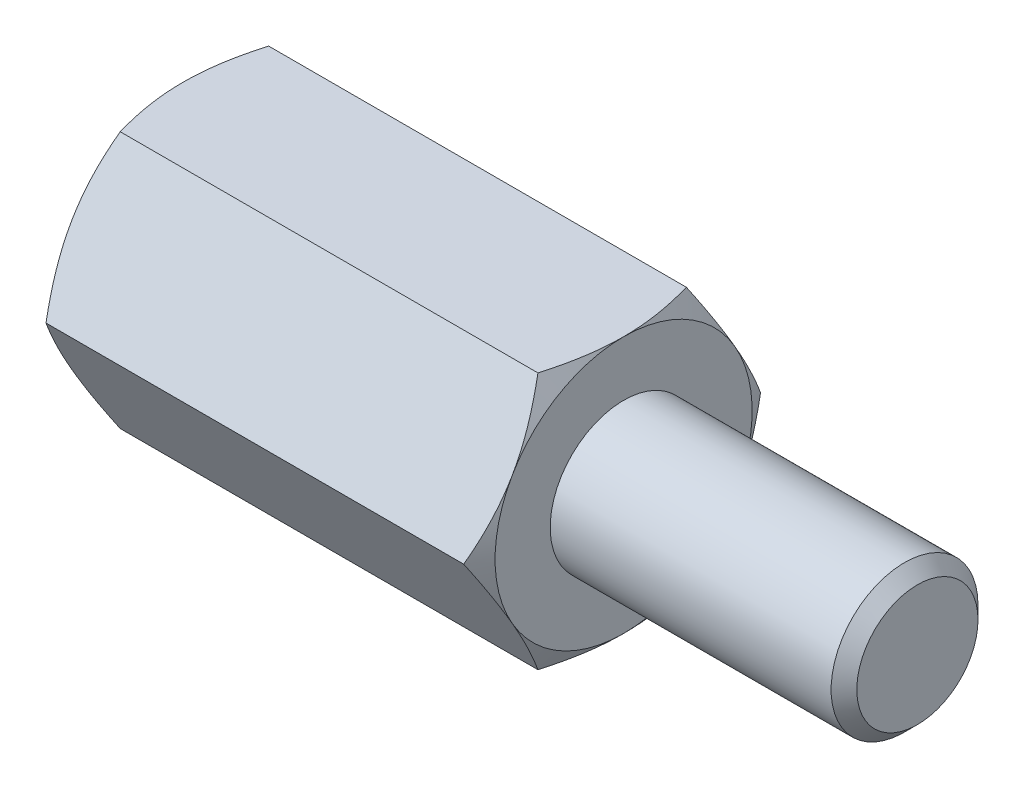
ISO-10303-21;
HEADER;
FILE_DESCRIPTION(('STEP AP214'),'2;1');
FILE_NAME('part.step','',(''),(''),'','','');
FILE_SCHEMA(('AUTOMOTIVE_DESIGN { 1 0 10303 214 1 1 1 1 }'));
ENDSEC;
DATA;
#1=APPLICATION_CONTEXT('core data for automotive mechanical design processes');
#2=APPLICATION_PROTOCOL_DEFINITION('international standard','automotive_design',2000,#1);
#3=PRODUCT_CONTEXT('',#1,'mechanical');
#4=PRODUCT('Part','Part','',(#3));
#5=PRODUCT_RELATED_PRODUCT_CATEGORY('part','',(#4));
#6=PRODUCT_DEFINITION_FORMATION('','',#4);
#7=PRODUCT_DEFINITION_CONTEXT('part definition',#1,'design');
#8=PRODUCT_DEFINITION('design','',#6,#7);
#9=PRODUCT_DEFINITION_SHAPE('','',#8);
#10=(LENGTH_UNIT() NAMED_UNIT(*) SI_UNIT(.MILLI.,.METRE.));
#11=(NAMED_UNIT(*) PLANE_ANGLE_UNIT() SI_UNIT($,.RADIAN.));
#12=(NAMED_UNIT(*) SI_UNIT($,.STERADIAN.) SOLID_ANGLE_UNIT());
#13=UNCERTAINTY_MEASURE_WITH_UNIT(LENGTH_MEASURE(1.E-05),#10,'distance_accuracy_value','');
#14=(GEOMETRIC_REPRESENTATION_CONTEXT(3) GLOBAL_UNCERTAINTY_ASSIGNED_CONTEXT((#13)) GLOBAL_UNIT_ASSIGNED_CONTEXT((#10,
#11,#12)) REPRESENTATION_CONTEXT('',''));
#15=CARTESIAN_POINT('',(0.,0.,0.));
#16=DIRECTION('',(0.,0.,1.));
#17=DIRECTION('',(1.,0.,0.));
#18=AXIS2_PLACEMENT_3D('',#15,#16,#17);
#19=CARTESIAN_POINT('',(6.,3.5,-2.02072594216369));
#20=DIRECTION('',(1.,0.,0.));
#21=DIRECTION('',(0.,0.,-1.));
#22=AXIS2_PLACEMENT_3D('',#19,#20,#21);
#23=PLANE('',#22);
#24=CARTESIAN_POINT('',(6.,0.,0.));
#25=DIRECTION('',(1.,0.,0.));
#26=DIRECTION('',(0.,0.,-1.));
#27=AXIS2_PLACEMENT_3D('',#24,#25,#26);
#28=CIRCLE('',#27,3.5);
#29=CARTESIAN_POINT('',(6.,-1.75,-3.03108891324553));
#30=VERTEX_POINT('',#29);
#31=CARTESIAN_POINT('',(6.,1.75,-3.03108891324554));
#32=VERTEX_POINT('',#31);
#33=EDGE_CURVE('E288',#30,#32,#28,.T.);
#34=ORIENTED_EDGE('',*,*,#33,.T.);
#35=CARTESIAN_POINT('',(6.,3.5,0.));
#36=VERTEX_POINT('',#35);
#37=EDGE_CURVE('E53',#32,#36,#28,.T.);
#38=ORIENTED_EDGE('',*,*,#37,.T.);
#39=CARTESIAN_POINT('',(6.,1.75,3.03108891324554));
#40=VERTEX_POINT('',#39);
#41=EDGE_CURVE('E297',#36,#40,#28,.T.);
#42=ORIENTED_EDGE('',*,*,#41,.T.);
#43=CARTESIAN_POINT('',(6.,-1.75,3.03108891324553));
#44=VERTEX_POINT('',#43);
#45=EDGE_CURVE('E301',#40,#44,#28,.T.);
#46=ORIENTED_EDGE('',*,*,#45,.T.);
#47=CARTESIAN_POINT('',(6.,0.,0.));
#48=DIRECTION('',(-1.,0.,0.));
#49=DIRECTION('',(0.,-1.,0.));
#50=AXIS2_PLACEMENT_3D('',#47,#48,#49);
#51=CIRCLE('',#50,3.5);
#52=CARTESIAN_POINT('',(6.,-3.5,0.));
#53=VERTEX_POINT('',#52);
#54=EDGE_CURVE('E193',#53,#44,#51,.T.);
#55=ORIENTED_EDGE('',*,*,#54,.F.);
#56=EDGE_CURVE('E61',#53,#30,#28,.T.);
#57=ORIENTED_EDGE('',*,*,#56,.T.);
#58=EDGE_LOOP('',(#34,#38,#42,#46,#55,#57));
#59=FACE_BOUND('',#58,.T.);
#60=CARTESIAN_POINT('',(6.,0.,0.));
#61=DIRECTION('',(1.,0.,0.));
#62=DIRECTION('',(0.,0.,-1.));
#63=AXIS2_PLACEMENT_3D('',#60,#61,#62);
#64=CIRCLE('',#63,2.);
#65=CARTESIAN_POINT('',(6.,0.,-2.));
#66=VERTEX_POINT('',#65);
#67=EDGE_CURVE('E311',#66,#66,#64,.T.);
#68=ORIENTED_EDGE('',*,*,#67,.F.);
#69=EDGE_LOOP('',(#68));
#70=FACE_BOUND('',#69,.T.);
#71=ADVANCED_FACE('F37',(#59,#70),#23,.T.);
#72=CARTESIAN_POINT('',(6.,0.,-4.04145188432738));
#73=DIRECTION('',(0.,-0.5,0.866025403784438));
#74=DIRECTION('',(0.,-0.866025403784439,-0.5));
#75=AXIS2_PLACEMENT_3D('',#72,#73,#74);
#76=PLANE('',#75);
#77=CARTESIAN_POINT('',(5.68732593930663,-0.000200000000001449,-4.04156735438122));
#78=CARTESIAN_POINT('',(5.73861421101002,0.153607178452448,-3.9527667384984));
#79=CARTESIAN_POINT('',(5.78525904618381,0.308742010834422,-3.86319960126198));
#80=CARTESIAN_POINT('',(5.86667812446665,0.621698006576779,-3.68251437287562));
#81=CARTESIAN_POINT('',(5.90142356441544,0.779524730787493,-3.59139307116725));
#82=CARTESIAN_POINT('',(5.95550997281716,1.09322221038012,-3.41027974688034));
#83=CARTESIAN_POINT('',(5.97521091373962,1.24904469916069,-3.32031559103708));
#84=CARTESIAN_POINT('',(5.99872986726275,1.56142288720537,-3.13996396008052));
#85=CARTESIAN_POINT('',(6.00256735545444,1.71797745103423,-3.04957714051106));
#86=CARTESIAN_POINT('',(5.99458469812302,2.01050921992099,-2.88068384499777));
#87=CARTESIAN_POINT('',(5.98472456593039,2.1465302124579,-2.80215208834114));
#88=CARTESIAN_POINT('',(5.9534735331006,2.41768602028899,-2.64560020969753));
#89=CARTESIAN_POINT('',(5.9320719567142,2.55281989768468,-2.5675806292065));
#90=CARTESIAN_POINT('',(5.87856959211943,2.82453479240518,-2.41070596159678));
#91=CARTESIAN_POINT('',(5.84624200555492,2.96108141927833,-2.33187072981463));
#92=CARTESIAN_POINT('',(5.77287106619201,3.2321380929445,-2.17537608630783));
#93=CARTESIAN_POINT('',(5.73184495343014,3.36665161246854,-2.09771466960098));
#94=CARTESIAN_POINT('',(5.68732593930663,3.5002,-2.02061047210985));
#95=B_SPLINE_CURVE_WITH_KNOTS('',3,(#77,#78,#79,#80,#81,#82,#83,#84,#85,#86,#87,#88,#89,#90,#91,
#92,#93,#94),.UNSPECIFIED.,.F.,.F.,(4,2,2,2,2,2,2,2,4),(0.,0.554793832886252,1.11092123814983,
1.65328467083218,2.19498204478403,2.6666513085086,3.13875761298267,3.6213361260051,
4.10296698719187),.UNSPECIFIED.);
#96=CARTESIAN_POINT('',(5.68739260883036,0.,-4.04145188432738));
#97=VERTEX_POINT('',#96);
#98=EDGE_CURVE('E315',#97,#32,#95,.T.);
#99=ORIENTED_EDGE('',*,*,#98,.F.);
#100=DIRECTION('',(-1.,0.,0.));
#101=VECTOR('',#100,1.);
#102=CARTESIAN_POINT('',(6.,0.,-4.04145188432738));
#103=LINE('',#102,#101);
#104=CARTESIAN_POINT('',(-5.68739260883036,0.,-4.04145188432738));
#105=VERTEX_POINT('',#104);
#106=EDGE_CURVE('E264',#97,#105,#103,.T.);
#107=ORIENTED_EDGE('',*,*,#106,.T.);
#108=CARTESIAN_POINT('',(-5.68732593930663,3.5002,-2.02061047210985));
#109=CARTESIAN_POINT('',(-5.73861421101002,3.34639282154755,-2.10941108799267));
#110=CARTESIAN_POINT('',(-5.78525904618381,3.19125798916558,-2.19897822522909));
#111=CARTESIAN_POINT('',(-5.86667812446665,2.87830199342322,-2.37966345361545));
#112=CARTESIAN_POINT('',(-5.90142356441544,2.7204752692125,-2.47078475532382));
#113=CARTESIAN_POINT('',(-5.95550997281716,2.40677778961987,-2.65189807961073));
#114=CARTESIAN_POINT('',(-5.97521091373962,2.25095530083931,-2.74186223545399));
#115=CARTESIAN_POINT('',(-5.99872986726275,1.93857711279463,-2.92221386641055));
#116=CARTESIAN_POINT('',(-6.00256735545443,1.78202254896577,-3.01260068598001));
#117=CARTESIAN_POINT('',(-5.99458469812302,1.48949078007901,-3.1814939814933));
#118=CARTESIAN_POINT('',(-5.98472456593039,1.3534697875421,-3.26002573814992));
#119=CARTESIAN_POINT('',(-5.9534735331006,1.08231397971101,-3.41657761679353));
#120=CARTESIAN_POINT('',(-5.9320719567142,0.947180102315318,-3.49459719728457));
#121=CARTESIAN_POINT('',(-5.87856959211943,0.675465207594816,-3.65147186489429));
#122=CARTESIAN_POINT('',(-5.84624200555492,0.538918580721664,-3.73030709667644));
#123=CARTESIAN_POINT('',(-5.77287106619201,0.267861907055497,-3.88680174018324));
#124=CARTESIAN_POINT('',(-5.73184495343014,0.133348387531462,-3.96446315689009));
#125=CARTESIAN_POINT('',(-5.68732593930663,-0.000200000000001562,-4.04156735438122));
#126=B_SPLINE_CURVE_WITH_KNOTS('',3,(#108,#109,#110,#111,#112,#113,#114,#115,#116,#117,#118,
#119,#120,#121,#122,#123,#124,#125),.UNSPECIFIED.,.F.,.F.,(4,2,2,2,2,2,2,2,4),(0.,
0.554793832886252,1.11092123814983,1.65328467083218,2.19498204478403,2.6666513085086,
3.13875761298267,3.6213361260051,4.10296698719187),.UNSPECIFIED.);
#127=CARTESIAN_POINT('',(-6.,1.75,-3.03108891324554));
#128=VERTEX_POINT('',#127);
#129=EDGE_CURVE('E367',#128,#105,#126,.T.);
#130=ORIENTED_EDGE('',*,*,#129,.F.);
#131=CARTESIAN_POINT('',(-5.68739260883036,3.5,-2.02072594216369));
#132=VERTEX_POINT('',#131);
#133=EDGE_CURVE('E371',#132,#128,#126,.T.);
#134=ORIENTED_EDGE('',*,*,#133,.F.);
#135=DIRECTION('',(-1.,0.,0.));
#136=VECTOR('',#135,1.);
#137=CARTESIAN_POINT('',(6.,3.5,-2.02072594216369));
#138=LINE('',#137,#136);
#139=CARTESIAN_POINT('',(5.68739260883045,3.5,-2.02072594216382));
#140=VERTEX_POINT('',#139);
#141=EDGE_CURVE('E279',#140,#132,#138,.T.);
#142=ORIENTED_EDGE('',*,*,#141,.F.);
#143=EDGE_CURVE('E229',#32,#140,#95,.T.);
#144=ORIENTED_EDGE('',*,*,#143,.F.);
#145=EDGE_LOOP('',(#99,#107,#130,#134,#142,#144));
#146=FACE_BOUND('',#145,.T.);
#147=ADVANCED_FACE('F148',(#146),#76,.F.);
#148=CARTESIAN_POINT('',(6.,3.5,-2.02072594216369));
#149=DIRECTION('',(0.,-1.,0.));
#150=DIRECTION('',(0.,0.,-1.));
#151=AXIS2_PLACEMENT_3D('',#148,#149,#150);
#152=PLANE('',#151);
#153=CARTESIAN_POINT('',(4.24432944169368,3.5,-5.52571367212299));
#154=CARTESIAN_POINT('',(4.3192813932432,3.5,-5.37200190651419));
#155=CARTESIAN_POINT('',(4.39354243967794,3.5,-5.21794762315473));
#156=CARTESIAN_POINT('',(4.54029601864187,3.5,-4.90897223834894));
#157=CARTESIAN_POINT('',(4.61278829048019,3.5,-4.75405101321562));
#158=CARTESIAN_POINT('',(4.75596172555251,3.5,-4.44240758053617));
#159=CARTESIAN_POINT('',(4.82663168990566,3.5,-4.28568021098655));
#160=CARTESIAN_POINT('',(4.96520746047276,3.5,-3.97101270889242));
#161=CARTESIAN_POINT('',(5.03311339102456,3.5,-3.81307263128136));
#162=CARTESIAN_POINT('',(5.16771439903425,3.5,-3.49026114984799));
#163=CARTESIAN_POINT('',(5.23428710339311,3.5,-3.32533845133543));
#164=CARTESIAN_POINT('',(5.36262677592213,3.5,-2.99359992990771));
#165=CARTESIAN_POINT('',(5.42439321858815,3.5,-2.82678390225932));
#166=CARTESIAN_POINT('',(5.54157006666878,3.5,-2.49127529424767));
#167=CARTESIAN_POINT('',(5.59699254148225,3.5,-2.32258697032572));
#168=CARTESIAN_POINT('',(5.69976794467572,3.5,-1.98279215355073));
#169=CARTESIAN_POINT('',(5.74712331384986,3.5,-1.81168640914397));
#170=CARTESIAN_POINT('',(5.83129873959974,3.5,-1.46793354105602));
#171=CARTESIAN_POINT('',(5.86817965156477,3.5,-1.2953015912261));
#172=CARTESIAN_POINT('',(5.92939557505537,3.5,-0.94779164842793));
#173=CARTESIAN_POINT('',(5.95373192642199,3.5,-0.772913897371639));
#174=CARTESIAN_POINT('',(5.9876038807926,3.5,-0.424108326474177));
#175=CARTESIAN_POINT('',(5.99733725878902,3.5,-0.25020019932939));
#176=CARTESIAN_POINT('',(6.00170533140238,3.5,0.0978233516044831));
#177=CARTESIAN_POINT('',(5.99633996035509,3.5,0.271938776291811));
#178=CARTESIAN_POINT('',(5.97501181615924,3.5,0.564711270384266));
#179=CARTESIAN_POINT('',(5.96289198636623,3.5,0.683667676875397));
#180=CARTESIAN_POINT('',(5.93230809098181,3.5,0.920767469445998));
#181=CARTESIAN_POINT('',(5.91384324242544,3.5,1.03891075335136));
#182=CARTESIAN_POINT('',(5.84989562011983,3.5,1.39193174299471));
#183=CARTESIAN_POINT('',(5.79586958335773,3.5,1.62528232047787));
#184=CARTESIAN_POINT('',(5.70145152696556,3.5,1.97433825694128));
#185=CARTESIAN_POINT('',(5.66729009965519,3.5,2.09183268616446));
#186=CARTESIAN_POINT('',(5.59523444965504,3.5,2.32568238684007));
#187=CARTESIAN_POINT('',(5.55734019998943,3.5,2.44203765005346));
#188=CARTESIAN_POINT('',(5.47844216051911,3.5,2.67364238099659));
#189=CARTESIAN_POINT('',(5.43743925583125,3.5,2.78889215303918));
#190=CARTESIAN_POINT('',(5.35282457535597,3.5,3.01842460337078));
#191=CARTESIAN_POINT('',(5.30921284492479,3.5,3.13270729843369));
#192=CARTESIAN_POINT('',(5.19582414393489,3.5,3.42150510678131));
#193=CARTESIAN_POINT('',(5.12456360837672,3.5,3.59543696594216));
#194=CARTESIAN_POINT('',(4.97810267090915,3.5,3.94163961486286));
#195=CARTESIAN_POINT('',(4.90290192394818,3.5,4.11391025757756));
#196=CARTESIAN_POINT('',(4.74942525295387,3.5,4.45713072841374));
#197=CARTESIAN_POINT('',(4.67114846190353,3.5,4.62808016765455));
#198=CARTESIAN_POINT('',(4.51218826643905,3.5,4.96885843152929));
#199=CARTESIAN_POINT('',(4.43150479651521,3.5,5.13868722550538));
#200=CARTESIAN_POINT('',(4.18638713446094,3.5,5.64726192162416));
#201=CARTESIAN_POINT('',(4.0190975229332,3.5,5.98463020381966));
#202=CARTESIAN_POINT('',(3.67958549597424,3.5,6.65678495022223));
#203=CARTESIAN_POINT('',(3.5073639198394,3.5,6.99157184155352));
#204=CARTESIAN_POINT('',(3.17608002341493,3.5,7.62749570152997));
#205=CARTESIAN_POINT('',(3.01732992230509,3.5,7.92879562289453));
#206=CARTESIAN_POINT('',(2.69774734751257,3.5,8.53030635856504));
#207=CARTESIAN_POINT('',(2.53691477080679,3.5,8.83051711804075));
#208=CARTESIAN_POINT('',(2.21417926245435,3.5,9.42918006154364));
#209=CARTESIAN_POINT('',(2.0522810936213,3.5,9.72763481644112));
#210=CARTESIAN_POINT('',(1.7272737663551,3.5,10.3238577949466));
#211=CARTESIAN_POINT('',(1.56416469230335,3.5,10.6216260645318));
#212=CARTESIAN_POINT('',(1.40061041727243,3.5,10.9191478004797));
#213=B_SPLINE_CURVE_WITH_KNOTS('',3,(#153,#154,#155,#156,#157,#158,#159,#160,#161,#162,#163,
#164,#165,#166,#167,#168,#169,#170,#171,#172,#173,#174,#175,#176,#177,#178,#179,#180,#181,#182,
#183,#184,#185,#186,#187,#188,#189,#190,#191,#192,#193,#194,#195,#196,#197,#198,#199,#200,#201,
#202,#203,#204,#205,#206,#207,#208,#209,#210,#211,#212),.UNSPECIFIED.,.F.,.F.,(4,2,2,2,2,2,2,2,
2,2,2,2,2,2,2,2,2,2,2,2,2,2,2,2,2,2,2,2,2,4),(0.,0.513041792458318,1.02615874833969,
1.54190801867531,2.05763406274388,2.59113284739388,3.1246898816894,3.65721433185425,
4.18957737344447,4.71878103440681,5.24792816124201,5.76984197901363,6.29175806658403,
6.65030258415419,7.0088913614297,7.72642330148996,8.09346920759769,8.46051776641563,
8.82746220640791,9.19440026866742,9.75822236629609,10.3220939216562,10.8861255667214,
11.4501725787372,12.579801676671,13.7092396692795,14.730918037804,15.7526471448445,
16.7712589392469,17.7898004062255),.UNSPECIFIED.);
#214=EDGE_CURVE('E227',#140,#36,#213,.T.);
#215=ORIENTED_EDGE('',*,*,#214,.F.);
#216=ORIENTED_EDGE('',*,*,#141,.T.);
#217=CARTESIAN_POINT('',(-4.24432944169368,3.5,-5.52571367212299));
#218=CARTESIAN_POINT('',(-4.3192813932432,3.5,-5.37200190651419));
#219=CARTESIAN_POINT('',(-4.39354243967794,3.5,-5.21794762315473));
#220=CARTESIAN_POINT('',(-4.54029601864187,3.5,-4.90897223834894));
#221=CARTESIAN_POINT('',(-4.61278829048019,3.5,-4.75405101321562));
#222=CARTESIAN_POINT('',(-4.75596172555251,3.5,-4.44240758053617));
#223=CARTESIAN_POINT('',(-4.82663168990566,3.5,-4.28568021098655));
#224=CARTESIAN_POINT('',(-4.96520746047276,3.5,-3.97101270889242));
#225=CARTESIAN_POINT('',(-5.03311339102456,3.5,-3.81307263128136));
#226=CARTESIAN_POINT('',(-5.16771439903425,3.5,-3.49026114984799));
#227=CARTESIAN_POINT('',(-5.23428710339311,3.5,-3.32533845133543));
#228=CARTESIAN_POINT('',(-5.36262677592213,3.5,-2.99359992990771));
#229=CARTESIAN_POINT('',(-5.42439321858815,3.5,-2.82678390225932));
#230=CARTESIAN_POINT('',(-5.54157006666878,3.5,-2.49127529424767));
#231=CARTESIAN_POINT('',(-5.59699254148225,3.5,-2.32258697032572));
#232=CARTESIAN_POINT('',(-5.69976794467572,3.5,-1.98279215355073));
#233=CARTESIAN_POINT('',(-5.74712331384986,3.5,-1.81168640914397));
#234=CARTESIAN_POINT('',(-5.83129873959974,3.5,-1.46793354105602));
#235=CARTESIAN_POINT('',(-5.86817965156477,3.5,-1.2953015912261));
#236=CARTESIAN_POINT('',(-5.92939557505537,3.5,-0.94779164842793));
#237=CARTESIAN_POINT('',(-5.95373192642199,3.5,-0.772913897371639));
#238=CARTESIAN_POINT('',(-5.9876038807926,3.5,-0.424108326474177));
#239=CARTESIAN_POINT('',(-5.99733725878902,3.5,-0.25020019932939));
#240=CARTESIAN_POINT('',(-6.00170533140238,3.5,0.097823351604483));
#241=CARTESIAN_POINT('',(-5.99633996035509,3.5,0.271938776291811));
#242=CARTESIAN_POINT('',(-5.97501181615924,3.5,0.564711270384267));
#243=CARTESIAN_POINT('',(-5.96289198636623,3.5,0.683667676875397));
#244=CARTESIAN_POINT('',(-5.93230809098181,3.5,0.920767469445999));
#245=CARTESIAN_POINT('',(-5.91384324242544,3.5,1.03891075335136));
#246=CARTESIAN_POINT('',(-5.84989562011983,3.5,1.39193174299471));
#247=CARTESIAN_POINT('',(-5.79586958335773,3.5,1.62528232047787));
#248=CARTESIAN_POINT('',(-5.70145152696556,3.5,1.97433825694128));
#249=CARTESIAN_POINT('',(-5.66729009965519,3.5,2.09183268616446));
#250=CARTESIAN_POINT('',(-5.59523444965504,3.5,2.32568238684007));
#251=CARTESIAN_POINT('',(-5.55734019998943,3.5,2.44203765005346));
#252=CARTESIAN_POINT('',(-5.47844216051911,3.5,2.67364238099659));
#253=CARTESIAN_POINT('',(-5.43743925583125,3.5,2.78889215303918));
#254=CARTESIAN_POINT('',(-5.35282457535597,3.5,3.01842460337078));
#255=CARTESIAN_POINT('',(-5.30921284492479,3.5,3.13270729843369));
#256=CARTESIAN_POINT('',(-5.19582414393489,3.5,3.42150510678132));
#257=CARTESIAN_POINT('',(-5.12456360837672,3.5,3.59543696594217));
#258=CARTESIAN_POINT('',(-4.97810267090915,3.5,3.94163961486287));
#259=CARTESIAN_POINT('',(-4.90290192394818,3.5,4.11391025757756));
#260=CARTESIAN_POINT('',(-4.74942525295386,3.5,4.45713072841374));
#261=CARTESIAN_POINT('',(-4.67114846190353,3.5,4.62808016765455));
#262=CARTESIAN_POINT('',(-4.51218826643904,3.5,4.9688584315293));
#263=CARTESIAN_POINT('',(-4.43150479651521,3.5,5.13868722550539));
#264=CARTESIAN_POINT('',(-4.18638713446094,3.5,5.64726192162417));
#265=CARTESIAN_POINT('',(-4.0190975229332,3.5,5.98463020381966));
#266=CARTESIAN_POINT('',(-3.67958549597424,3.5,6.65678495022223));
#267=CARTESIAN_POINT('',(-3.50736391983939,3.5,6.99157184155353));
#268=CARTESIAN_POINT('',(-3.17608002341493,3.5,7.62749570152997));
#269=CARTESIAN_POINT('',(-3.01732992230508,3.5,7.92879562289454));
#270=CARTESIAN_POINT('',(-2.69774734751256,3.5,8.53030635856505));
#271=CARTESIAN_POINT('',(-2.53691477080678,3.5,8.83051711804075));
#272=CARTESIAN_POINT('',(-2.21417926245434,3.5,9.42918006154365));
#273=CARTESIAN_POINT('',(-2.0522810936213,3.5,9.72763481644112));
#274=CARTESIAN_POINT('',(-1.7272737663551,3.5,10.3238577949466));
#275=CARTESIAN_POINT('',(-1.56416469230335,3.5,10.6216260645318));
#276=CARTESIAN_POINT('',(-1.40061041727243,3.5,10.9191478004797));
#277=B_SPLINE_CURVE_WITH_KNOTS('',3,(#217,#218,#219,#220,#221,#222,#223,#224,#225,#226,#227,
#228,#229,#230,#231,#232,#233,#234,#235,#236,#237,#238,#239,#240,#241,#242,#243,#244,#245,#246,
#247,#248,#249,#250,#251,#252,#253,#254,#255,#256,#257,#258,#259,#260,#261,#262,#263,#264,#265,
#266,#267,#268,#269,#270,#271,#272,#273,#274,#275,#276),.UNSPECIFIED.,.F.,.F.,(4,2,2,2,2,2,2,2,
2,2,2,2,2,2,2,2,2,2,2,2,2,2,2,2,2,2,2,2,2,4),(0.,0.513041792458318,1.02615874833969,
1.54190801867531,2.05763406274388,2.59113284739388,3.1246898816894,3.65721433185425,
4.18957737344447,4.71878103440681,5.24792816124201,5.76984197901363,6.29175806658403,
6.65030258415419,7.00889136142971,7.72642330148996,8.09346920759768,8.46051776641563,
8.8274622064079,9.19440026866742,9.75822236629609,10.3220939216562,10.8861255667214,
11.4501725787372,12.579801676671,13.7092396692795,14.730918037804,15.7526471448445,
16.771258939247,17.7898004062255),.UNSPECIFIED.);
#278=CARTESIAN_POINT('',(-6.,3.5,0.));
#279=VERTEX_POINT('',#278);
#280=EDGE_CURVE('E241',#279,#132,#277,.F.);
#281=ORIENTED_EDGE('',*,*,#280,.F.);
#282=CARTESIAN_POINT('',(-5.68739260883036,3.5,2.02072594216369));
#283=VERTEX_POINT('',#282);
#284=EDGE_CURVE('E249',#283,#279,#277,.F.);
#285=ORIENTED_EDGE('',*,*,#284,.F.);
#286=DIRECTION('',(-1.,0.,0.));
#287=VECTOR('',#286,1.);
#288=CARTESIAN_POINT('',(6.,3.5,2.02072594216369));
#289=LINE('',#288,#287);
#290=CARTESIAN_POINT('',(5.68739260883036,3.5,2.02072594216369));
#291=VERTEX_POINT('',#290);
#292=EDGE_CURVE('E276',#291,#283,#289,.T.);
#293=ORIENTED_EDGE('',*,*,#292,.F.);
#294=EDGE_CURVE('E221',#36,#291,#213,.T.);
#295=ORIENTED_EDGE('',*,*,#294,.F.);
#296=EDGE_LOOP('',(#215,#216,#281,#285,#293,#295));
#297=FACE_BOUND('',#296,.T.);
#298=ADVANCED_FACE('F153',(#297),#152,.F.);
#299=CARTESIAN_POINT('',(6.,3.5,2.02072594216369));
#300=DIRECTION('',(0.,-0.5,-0.866025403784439));
#301=DIRECTION('',(0.,0.866025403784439,-0.5));
#302=AXIS2_PLACEMENT_3D('',#299,#300,#301);
#303=PLANE('',#302);
#304=CARTESIAN_POINT('',(5.68732593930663,3.5002,2.02061047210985));
#305=CARTESIAN_POINT('',(5.73861421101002,3.34639282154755,2.10941108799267));
#306=CARTESIAN_POINT('',(5.78525904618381,3.19125798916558,2.19897822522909));
#307=CARTESIAN_POINT('',(5.86667812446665,2.87830199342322,2.37966345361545));
#308=CARTESIAN_POINT('',(5.90142356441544,2.7204752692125,2.47078475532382));
#309=CARTESIAN_POINT('',(5.95550997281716,2.40677778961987,2.65189807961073));
#310=CARTESIAN_POINT('',(5.97521091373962,2.25095530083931,2.74186223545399));
#311=CARTESIAN_POINT('',(5.99872986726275,1.93857711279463,2.92221386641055));
#312=CARTESIAN_POINT('',(6.00256735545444,1.78202254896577,3.01260068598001));
#313=CARTESIAN_POINT('',(5.99458469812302,1.48949078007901,3.1814939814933));
#314=CARTESIAN_POINT('',(5.98472456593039,1.35346978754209,3.26002573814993));
#315=CARTESIAN_POINT('',(5.9534735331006,1.08231397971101,3.41657761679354));
#316=CARTESIAN_POINT('',(5.9320719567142,0.947180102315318,3.49459719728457));
#317=CARTESIAN_POINT('',(5.87856959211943,0.675465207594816,3.65147186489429));
#318=CARTESIAN_POINT('',(5.84624200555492,0.538918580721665,3.73030709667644));
#319=CARTESIAN_POINT('',(5.77287106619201,0.267861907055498,3.88680174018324));
#320=CARTESIAN_POINT('',(5.73184495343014,0.133348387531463,3.96446315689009));
#321=CARTESIAN_POINT('',(5.68732593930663,-0.000200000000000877,4.04156735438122));
#322=B_SPLINE_CURVE_WITH_KNOTS('',3,(#304,#305,#306,#307,#308,#309,#310,#311,#312,#313,#314,
#315,#316,#317,#318,#319,#320,#321),.UNSPECIFIED.,.F.,.F.,(4,2,2,2,2,2,2,2,4),(0.,
0.554793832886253,1.11092123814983,1.65328467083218,2.19498204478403,2.6666513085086,
3.13875761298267,3.62133612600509,4.10296698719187),.UNSPECIFIED.);
#323=EDGE_CURVE('E228',#291,#40,#322,.T.);
#324=ORIENTED_EDGE('',*,*,#323,.F.);
#325=ORIENTED_EDGE('',*,*,#292,.T.);
#326=CARTESIAN_POINT('',(-5.68732593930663,-0.000200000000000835,4.04156735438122));
#327=CARTESIAN_POINT('',(-5.73861421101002,0.153607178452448,3.9527667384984));
#328=CARTESIAN_POINT('',(-5.78525904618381,0.308742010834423,3.86319960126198));
#329=CARTESIAN_POINT('',(-5.86667812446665,0.62169800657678,3.68251437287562));
#330=CARTESIAN_POINT('',(-5.90142356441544,0.779524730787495,3.59139307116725));
#331=CARTESIAN_POINT('',(-5.95550997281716,1.09322221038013,3.41027974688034));
#332=CARTESIAN_POINT('',(-5.97521091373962,1.24904469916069,3.32031559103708));
#333=CARTESIAN_POINT('',(-5.99872986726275,1.56142288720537,3.13996396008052));
#334=CARTESIAN_POINT('',(-6.00256735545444,1.71797745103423,3.04957714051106));
#335=CARTESIAN_POINT('',(-5.99458469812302,2.01050921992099,2.88068384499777));
#336=CARTESIAN_POINT('',(-5.98472456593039,2.1465302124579,2.80215208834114));
#337=CARTESIAN_POINT('',(-5.9534735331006,2.41768602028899,2.64560020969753));
#338=CARTESIAN_POINT('',(-5.9320719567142,2.55281989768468,2.5675806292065));
#339=CARTESIAN_POINT('',(-5.87856959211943,2.82453479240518,2.41070596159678));
#340=CARTESIAN_POINT('',(-5.84624200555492,2.96108141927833,2.33187072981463));
#341=CARTESIAN_POINT('',(-5.77287106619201,3.2321380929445,2.17537608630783));
#342=CARTESIAN_POINT('',(-5.73184495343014,3.36665161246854,2.09771466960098));
#343=CARTESIAN_POINT('',(-5.68732593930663,3.5002,2.02061047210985));
#344=B_SPLINE_CURVE_WITH_KNOTS('',3,(#326,#327,#328,#329,#330,#331,#332,#333,#334,#335,#336,
#337,#338,#339,#340,#341,#342,#343),.UNSPECIFIED.,.F.,.F.,(4,2,2,2,2,2,2,2,4),(0.,
0.554793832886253,1.11092123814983,1.65328467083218,2.19498204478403,2.6666513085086,
3.13875761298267,3.6213361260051,4.10296698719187),.UNSPECIFIED.);
#345=CARTESIAN_POINT('',(-6.,1.75,3.03108891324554));
#346=VERTEX_POINT('',#345);
#347=EDGE_CURVE('E255',#346,#283,#344,.T.);
#348=ORIENTED_EDGE('',*,*,#347,.F.);
#349=CARTESIAN_POINT('',(-5.68739260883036,0.,4.04145188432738));
#350=VERTEX_POINT('',#349);
#351=EDGE_CURVE('E262',#350,#346,#344,.T.);
#352=ORIENTED_EDGE('',*,*,#351,.F.);
#353=DIRECTION('',(-1.,0.,0.));
#354=VECTOR('',#353,1.);
#355=CARTESIAN_POINT('',(6.,0.,4.04145188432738));
#356=LINE('',#355,#354);
#357=CARTESIAN_POINT('',(5.68739260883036,0.,4.04145188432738));
#358=VERTEX_POINT('',#357);
#359=EDGE_CURVE('E273',#358,#350,#356,.T.);
#360=ORIENTED_EDGE('',*,*,#359,.F.);
#361=EDGE_CURVE('E215',#40,#358,#322,.T.);
#362=ORIENTED_EDGE('',*,*,#361,.F.);
#363=EDGE_LOOP('',(#324,#325,#348,#352,#360,#362));
#364=FACE_BOUND('',#363,.T.);
#365=ADVANCED_FACE('F235',(#364),#303,.F.);
#366=CARTESIAN_POINT('',(6.,0.,4.04145188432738));
#367=DIRECTION('',(0.,0.5,-0.866025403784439));
#368=DIRECTION('',(0.,0.866025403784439,0.5));
#369=AXIS2_PLACEMENT_3D('',#366,#367,#368);
#370=PLANE('',#369);
#371=CARTESIAN_POINT('',(5.68732593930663,0.000199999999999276,4.04156735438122));
#372=CARTESIAN_POINT('',(5.73861421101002,-0.15360717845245,3.9527667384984));
#373=CARTESIAN_POINT('',(5.78525904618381,-0.308742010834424,3.86319960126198));
#374=CARTESIAN_POINT('',(5.86667812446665,-0.621698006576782,3.68251437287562));
#375=CARTESIAN_POINT('',(5.90142356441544,-0.779524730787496,3.59139307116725));
#376=CARTESIAN_POINT('',(5.95550997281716,-1.09322221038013,3.41027974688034));
#377=CARTESIAN_POINT('',(5.97521091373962,-1.24904469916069,3.32031559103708));
#378=CARTESIAN_POINT('',(5.99872986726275,-1.56142288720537,3.13996396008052));
#379=CARTESIAN_POINT('',(6.00256735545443,-1.71797745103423,3.04957714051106));
#380=CARTESIAN_POINT('',(5.99458469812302,-2.01050921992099,2.88068384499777));
#381=CARTESIAN_POINT('',(5.98472456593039,-2.14653021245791,2.80215208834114));
#382=CARTESIAN_POINT('',(5.9534735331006,-2.41768602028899,2.64560020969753));
#383=CARTESIAN_POINT('',(5.9320719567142,-2.55281989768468,2.5675806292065));
#384=CARTESIAN_POINT('',(5.87856959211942,-2.82453479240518,2.41070596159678));
#385=CARTESIAN_POINT('',(5.84624200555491,-2.96108141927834,2.33187072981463));
#386=CARTESIAN_POINT('',(5.77287106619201,-3.2321380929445,2.17537608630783));
#387=CARTESIAN_POINT('',(5.73184495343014,-3.36665161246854,2.09771466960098));
#388=CARTESIAN_POINT('',(5.68732593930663,-3.5002,2.02061047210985));
#389=B_SPLINE_CURVE_WITH_KNOTS('',3,(#371,#372,#373,#374,#375,#376,#377,#378,#379,#380,#381,
#382,#383,#384,#385,#386,#387,#388),.UNSPECIFIED.,.F.,.F.,(4,2,2,2,2,2,2,2,4),(0.,
0.554793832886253,1.11092123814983,1.65328467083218,2.19498204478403,2.6666513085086,
3.13875761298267,3.62133612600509,4.10296698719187),.UNSPECIFIED.);
#390=EDGE_CURVE('E319',#358,#44,#389,.T.);
#391=ORIENTED_EDGE('',*,*,#390,.F.);
#392=ORIENTED_EDGE('',*,*,#359,.T.);
#393=CARTESIAN_POINT('',(-5.68732593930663,-3.5002,2.02061047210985));
#394=CARTESIAN_POINT('',(-5.73861421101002,-3.34639282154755,2.10941108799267));
#395=CARTESIAN_POINT('',(-5.78525904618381,-3.19125798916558,2.19897822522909));
#396=CARTESIAN_POINT('',(-5.86667812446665,-2.87830199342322,2.37966345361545));
#397=CARTESIAN_POINT('',(-5.90142356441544,-2.7204752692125,2.47078475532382));
#398=CARTESIAN_POINT('',(-5.95550997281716,-2.40677778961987,2.65189807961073));
#399=CARTESIAN_POINT('',(-5.97521091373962,-2.25095530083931,2.74186223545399));
#400=CARTESIAN_POINT('',(-5.99872986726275,-1.93857711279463,2.92221386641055));
#401=CARTESIAN_POINT('',(-6.00256735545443,-1.78202254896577,3.01260068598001));
#402=CARTESIAN_POINT('',(-5.99458469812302,-1.48949078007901,3.1814939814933));
#403=CARTESIAN_POINT('',(-5.98472456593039,-1.3534697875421,3.26002573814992));
#404=CARTESIAN_POINT('',(-5.9534735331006,-1.08231397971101,3.41657761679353));
#405=CARTESIAN_POINT('',(-5.9320719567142,-0.947180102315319,3.49459719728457));
#406=CARTESIAN_POINT('',(-5.87856959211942,-0.675465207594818,3.65147186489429));
#407=CARTESIAN_POINT('',(-5.84624200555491,-0.538918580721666,3.73030709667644));
#408=CARTESIAN_POINT('',(-5.77287106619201,-0.267861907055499,3.88680174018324));
#409=CARTESIAN_POINT('',(-5.73184495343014,-0.133348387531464,3.96446315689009));
#410=CARTESIAN_POINT('',(-5.68732593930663,0.000199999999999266,4.04156735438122));
#411=B_SPLINE_CURVE_WITH_KNOTS('',3,(#393,#394,#395,#396,#397,#398,#399,#400,#401,#402,#403,
#404,#405,#406,#407,#408,#409,#410),.UNSPECIFIED.,.F.,.F.,(4,2,2,2,2,2,2,2,4),(0.,
0.554793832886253,1.11092123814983,1.65328467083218,2.19498204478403,2.6666513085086,
3.13875761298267,3.62133612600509,4.10296698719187),.UNSPECIFIED.);
#412=CARTESIAN_POINT('',(-6.,-1.75,3.03108891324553));
#413=VERTEX_POINT('',#412);
#414=EDGE_CURVE('E263',#413,#350,#411,.T.);
#415=ORIENTED_EDGE('',*,*,#414,.F.);
#416=CARTESIAN_POINT('',(-5.68739260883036,-3.5,2.02072594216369));
#417=VERTEX_POINT('',#416);
#418=EDGE_CURVE('E250',#417,#413,#411,.T.);
#419=ORIENTED_EDGE('',*,*,#418,.F.);
#420=DIRECTION('',(-1.,0.,0.));
#421=VECTOR('',#420,1.);
#422=CARTESIAN_POINT('',(6.,-3.5,2.02072594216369));
#423=LINE('',#422,#421);
#424=CARTESIAN_POINT('',(5.68739260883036,-3.5,2.02072594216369));
#425=VERTEX_POINT('',#424);
#426=EDGE_CURVE('E270',#425,#417,#423,.T.);
#427=ORIENTED_EDGE('',*,*,#426,.F.);
#428=EDGE_CURVE('E210',#44,#425,#389,.T.);
#429=ORIENTED_EDGE('',*,*,#428,.F.);
#430=EDGE_LOOP('',(#391,#392,#415,#419,#427,#429));
#431=FACE_BOUND('',#430,.T.);
#432=ADVANCED_FACE('F403',(#431),#370,.F.);
#433=CARTESIAN_POINT('',(6.,-3.5,2.02072594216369));
#434=DIRECTION('',(0.,1.,0.));
#435=DIRECTION('',(0.,0.,1.));
#436=AXIS2_PLACEMENT_3D('',#433,#434,#435);
#437=PLANE('',#436);
#438=CARTESIAN_POINT('',(4.24432944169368,-3.5,-5.525713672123));
#439=CARTESIAN_POINT('',(4.3192813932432,-3.5,-5.37200190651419));
#440=CARTESIAN_POINT('',(4.39354243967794,-3.5,-5.21794762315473));
#441=CARTESIAN_POINT('',(4.54029601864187,-3.5,-4.90897223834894));
#442=CARTESIAN_POINT('',(4.61278829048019,-3.5,-4.75405101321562));
#443=CARTESIAN_POINT('',(4.75596172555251,-3.5,-4.44240758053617));
#444=CARTESIAN_POINT('',(4.82663168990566,-3.5,-4.28568021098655));
#445=CARTESIAN_POINT('',(4.96520746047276,-3.5,-3.97101270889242));
#446=CARTESIAN_POINT('',(5.03311339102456,-3.5,-3.81307263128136));
#447=CARTESIAN_POINT('',(5.16771439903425,-3.5,-3.49026114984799));
#448=CARTESIAN_POINT('',(5.23428710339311,-3.5,-3.32533845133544));
#449=CARTESIAN_POINT('',(5.36262677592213,-3.5,-2.99359992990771));
#450=CARTESIAN_POINT('',(5.42439321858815,-3.5,-2.82678390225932));
#451=CARTESIAN_POINT('',(5.54157006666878,-3.5,-2.49127529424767));
#452=CARTESIAN_POINT('',(5.59699254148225,-3.5,-2.32258697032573));
#453=CARTESIAN_POINT('',(5.69976794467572,-3.5,-1.98279215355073));
#454=CARTESIAN_POINT('',(5.74712331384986,-3.5,-1.81168640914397));
#455=CARTESIAN_POINT('',(5.83129873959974,-3.5,-1.46793354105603));
#456=CARTESIAN_POINT('',(5.86817965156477,-3.5,-1.2953015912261));
#457=CARTESIAN_POINT('',(5.92939557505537,-3.5,-0.947791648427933));
#458=CARTESIAN_POINT('',(5.95373192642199,-3.5,-0.772913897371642));
#459=CARTESIAN_POINT('',(5.9876038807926,-3.5,-0.42410832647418));
#460=CARTESIAN_POINT('',(5.99733725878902,-3.5,-0.250200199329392));
#461=CARTESIAN_POINT('',(6.00170533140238,-3.5,0.0978233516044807));
#462=CARTESIAN_POINT('',(5.99633996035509,-3.5,0.271938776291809));
#463=CARTESIAN_POINT('',(5.97501181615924,-3.5,0.564711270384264));
#464=CARTESIAN_POINT('',(5.96289198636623,-3.5,0.683667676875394));
#465=CARTESIAN_POINT('',(5.93230809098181,-3.5,0.920767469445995));
#466=CARTESIAN_POINT('',(5.91384324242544,-3.5,1.03891075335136));
#467=CARTESIAN_POINT('',(5.84989562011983,-3.5,1.39193174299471));
#468=CARTESIAN_POINT('',(5.79586958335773,-3.5,1.62528232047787));
#469=CARTESIAN_POINT('',(5.70145152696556,-3.5,1.97433825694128));
#470=CARTESIAN_POINT('',(5.66729009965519,-3.5,2.09183268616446));
#471=CARTESIAN_POINT('',(5.59523444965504,-3.5,2.32568238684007));
#472=CARTESIAN_POINT('',(5.55734019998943,-3.5,2.44203765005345));
#473=CARTESIAN_POINT('',(5.47844216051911,-3.5,2.67364238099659));
#474=CARTESIAN_POINT('',(5.43743925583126,-3.5,2.78889215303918));
#475=CARTESIAN_POINT('',(5.35282457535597,-3.5,3.01842460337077));
#476=CARTESIAN_POINT('',(5.3092128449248,-3.5,3.13270729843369));
#477=CARTESIAN_POINT('',(5.19582414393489,-3.5,3.42150510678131));
#478=CARTESIAN_POINT('',(5.12456360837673,-3.5,3.59543696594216));
#479=CARTESIAN_POINT('',(4.97810267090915,-3.5,3.94163961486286));
#480=CARTESIAN_POINT('',(4.90290192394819,-3.5,4.11391025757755));
#481=CARTESIAN_POINT('',(4.74942525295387,-3.5,4.45713072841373));
#482=CARTESIAN_POINT('',(4.67114846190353,-3.5,4.62808016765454));
#483=CARTESIAN_POINT('',(4.51218826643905,-3.5,4.96885843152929));
#484=CARTESIAN_POINT('',(4.43150479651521,-3.5,5.13868722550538));
#485=CARTESIAN_POINT('',(4.18638713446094,-3.5,5.64726192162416));
#486=CARTESIAN_POINT('',(4.0190975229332,-3.5,5.98463020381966));
#487=CARTESIAN_POINT('',(3.67958549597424,-3.5,6.65678495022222));
#488=CARTESIAN_POINT('',(3.5073639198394,-3.5,6.99157184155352));
#489=CARTESIAN_POINT('',(3.17608002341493,-3.5,7.62749570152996));
#490=CARTESIAN_POINT('',(3.01732992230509,-3.5,7.92879562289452));
#491=CARTESIAN_POINT('',(2.69774734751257,-3.5,8.53030635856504));
#492=CARTESIAN_POINT('',(2.53691477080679,-3.5,8.83051711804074));
#493=CARTESIAN_POINT('',(2.21417926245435,-3.5,9.42918006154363));
#494=CARTESIAN_POINT('',(2.0522810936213,-3.5,9.72763481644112));
#495=CARTESIAN_POINT('',(1.7272737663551,-3.5,10.3238577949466));
#496=CARTESIAN_POINT('',(1.56416469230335,-3.5,10.6216260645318));
#497=CARTESIAN_POINT('',(1.40061041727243,-3.5,10.9191478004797));
#498=B_SPLINE_CURVE_WITH_KNOTS('',3,(#438,#439,#440,#441,#442,#443,#444,#445,#446,#447,#448,
#449,#450,#451,#452,#453,#454,#455,#456,#457,#458,#459,#460,#461,#462,#463,#464,#465,#466,#467,
#468,#469,#470,#471,#472,#473,#474,#475,#476,#477,#478,#479,#480,#481,#482,#483,#484,#485,#486,
#487,#488,#489,#490,#491,#492,#493,#494,#495,#496,#497),.UNSPECIFIED.,.F.,.F.,(4,2,2,2,2,2,2,2,
2,2,2,2,2,2,2,2,2,2,2,2,2,2,2,2,2,2,2,2,2,4),(0.,0.513041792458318,1.02615874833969,
1.54190801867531,2.05763406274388,2.59113284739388,3.1246898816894,3.65721433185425,
4.18957737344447,4.71878103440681,5.24792816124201,5.76984197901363,6.29175806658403,
6.65030258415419,7.0088913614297,7.72642330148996,8.09346920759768,8.46051776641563,
8.8274622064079,9.19440026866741,9.75822236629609,10.3220939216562,10.8861255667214,
11.4501725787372,12.579801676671,13.7092396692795,14.730918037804,15.7526471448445,
16.7712589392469,17.7898004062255),.UNSPECIFIED.);
#499=EDGE_CURVE('E324',#425,#53,#498,.F.);
#500=ORIENTED_EDGE('',*,*,#499,.F.);
#501=ORIENTED_EDGE('',*,*,#426,.T.);
#502=CARTESIAN_POINT('',(-4.24432944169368,-3.5,-5.52571367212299));
#503=CARTESIAN_POINT('',(-4.3192813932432,-3.5,-5.37200190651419));
#504=CARTESIAN_POINT('',(-4.39354243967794,-3.5,-5.21794762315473));
#505=CARTESIAN_POINT('',(-4.54029601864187,-3.5,-4.90897223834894));
#506=CARTESIAN_POINT('',(-4.61278829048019,-3.5,-4.75405101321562));
#507=CARTESIAN_POINT('',(-4.75596172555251,-3.5,-4.44240758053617));
#508=CARTESIAN_POINT('',(-4.82663168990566,-3.5,-4.28568021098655));
#509=CARTESIAN_POINT('',(-4.96520746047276,-3.5,-3.97101270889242));
#510=CARTESIAN_POINT('',(-5.03311339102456,-3.5,-3.81307263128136));
#511=CARTESIAN_POINT('',(-5.16771439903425,-3.5,-3.49026114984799));
#512=CARTESIAN_POINT('',(-5.23428710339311,-3.5,-3.32533845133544));
#513=CARTESIAN_POINT('',(-5.36262677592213,-3.5,-2.99359992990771));
#514=CARTESIAN_POINT('',(-5.42439321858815,-3.5,-2.82678390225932));
#515=CARTESIAN_POINT('',(-5.54157006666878,-3.5,-2.49127529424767));
#516=CARTESIAN_POINT('',(-5.59699254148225,-3.5,-2.32258697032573));
#517=CARTESIAN_POINT('',(-5.69976794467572,-3.5,-1.98279215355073));
#518=CARTESIAN_POINT('',(-5.74712331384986,-3.5,-1.81168640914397));
#519=CARTESIAN_POINT('',(-5.83129873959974,-3.5,-1.46793354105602));
#520=CARTESIAN_POINT('',(-5.86817965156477,-3.5,-1.2953015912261));
#521=CARTESIAN_POINT('',(-5.92939557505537,-3.5,-0.947791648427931));
#522=CARTESIAN_POINT('',(-5.95373192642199,-3.5,-0.772913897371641));
#523=CARTESIAN_POINT('',(-5.9876038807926,-3.5,-0.424108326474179));
#524=CARTESIAN_POINT('',(-5.99733725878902,-3.5,-0.250200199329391));
#525=CARTESIAN_POINT('',(-6.00170533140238,-3.5,0.0978233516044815));
#526=CARTESIAN_POINT('',(-5.99633996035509,-3.5,0.271938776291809));
#527=CARTESIAN_POINT('',(-5.97501181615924,-3.5,0.564711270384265));
#528=CARTESIAN_POINT('',(-5.96289198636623,-3.5,0.683667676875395));
#529=CARTESIAN_POINT('',(-5.93230809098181,-3.5,0.920767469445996));
#530=CARTESIAN_POINT('',(-5.91384324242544,-3.5,1.03891075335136));
#531=CARTESIAN_POINT('',(-5.84989562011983,-3.5,1.39193174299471));
#532=CARTESIAN_POINT('',(-5.79586958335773,-3.5,1.62528232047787));
#533=CARTESIAN_POINT('',(-5.70145152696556,-3.5,1.97433825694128));
#534=CARTESIAN_POINT('',(-5.66729009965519,-3.5,2.09183268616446));
#535=CARTESIAN_POINT('',(-5.59523444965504,-3.5,2.32568238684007));
#536=CARTESIAN_POINT('',(-5.55734019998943,-3.5,2.44203765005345));
#537=CARTESIAN_POINT('',(-5.47844216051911,-3.5,2.67364238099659));
#538=CARTESIAN_POINT('',(-5.43743925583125,-3.5,2.78889215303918));
#539=CARTESIAN_POINT('',(-5.35282457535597,-3.5,3.01842460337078));
#540=CARTESIAN_POINT('',(-5.30921284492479,-3.5,3.13270729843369));
#541=CARTESIAN_POINT('',(-5.19582414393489,-3.5,3.42150510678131));
#542=CARTESIAN_POINT('',(-5.12456360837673,-3.5,3.59543696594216));
#543=CARTESIAN_POINT('',(-4.97810267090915,-3.5,3.94163961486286));
#544=CARTESIAN_POINT('',(-4.90290192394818,-3.5,4.11391025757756));
#545=CARTESIAN_POINT('',(-4.74942525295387,-3.5,4.45713072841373));
#546=CARTESIAN_POINT('',(-4.67114846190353,-3.5,4.62808016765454));
#547=CARTESIAN_POINT('',(-4.51218826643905,-3.5,4.96885843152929));
#548=CARTESIAN_POINT('',(-4.43150479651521,-3.5,5.13868722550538));
#549=CARTESIAN_POINT('',(-4.18638713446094,-3.5,5.64726192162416));
#550=CARTESIAN_POINT('',(-4.0190975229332,-3.5,5.98463020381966));
#551=CARTESIAN_POINT('',(-3.67958549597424,-3.5,6.65678495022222));
#552=CARTESIAN_POINT('',(-3.5073639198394,-3.5,6.99157184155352));
#553=CARTESIAN_POINT('',(-3.17608002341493,-3.5,7.62749570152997));
#554=CARTESIAN_POINT('',(-3.01732992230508,-3.5,7.92879562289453));
#555=CARTESIAN_POINT('',(-2.69774734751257,-3.5,8.53030635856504));
#556=CARTESIAN_POINT('',(-2.53691477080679,-3.5,8.83051711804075));
#557=CARTESIAN_POINT('',(-2.21417926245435,-3.5,9.42918006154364));
#558=CARTESIAN_POINT('',(-2.0522810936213,-3.5,9.72763481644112));
#559=CARTESIAN_POINT('',(-1.7272737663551,-3.5,10.3238577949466));
#560=CARTESIAN_POINT('',(-1.56416469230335,-3.5,10.6216260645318));
#561=CARTESIAN_POINT('',(-1.40061041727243,-3.5,10.9191478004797));
#562=B_SPLINE_CURVE_WITH_KNOTS('',3,(#502,#503,#504,#505,#506,#507,#508,#509,#510,#511,#512,
#513,#514,#515,#516,#517,#518,#519,#520,#521,#522,#523,#524,#525,#526,#527,#528,#529,#530,#531,
#532,#533,#534,#535,#536,#537,#538,#539,#540,#541,#542,#543,#544,#545,#546,#547,#548,#549,#550,
#551,#552,#553,#554,#555,#556,#557,#558,#559,#560,#561),.UNSPECIFIED.,.F.,.F.,(4,2,2,2,2,2,2,2,
2,2,2,2,2,2,2,2,2,2,2,2,2,2,2,2,2,2,2,2,2,4),(0.,0.513041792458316,1.02615874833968,
1.5419080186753,2.05763406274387,2.59113284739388,3.1246898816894,3.65721433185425,
4.18957737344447,4.71878103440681,5.24792816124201,5.76984197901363,6.29175806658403,
6.65030258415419,7.0088913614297,7.72642330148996,8.09346920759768,8.46051776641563,
8.8274622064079,9.19440026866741,9.75822236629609,10.3220939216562,10.8861255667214,
11.4501725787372,12.579801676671,13.7092396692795,14.730918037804,15.7526471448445,
16.7712589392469,17.7898004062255),.UNSPECIFIED.);
#563=CARTESIAN_POINT('',(-6.,-3.5,0.));
#564=VERTEX_POINT('',#563);
#565=EDGE_CURVE('E368',#564,#417,#562,.T.);
#566=ORIENTED_EDGE('',*,*,#565,.F.);
#567=CARTESIAN_POINT('',(-5.68739260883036,-3.5,-2.02072594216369));
#568=VERTEX_POINT('',#567);
#569=EDGE_CURVE('E363',#568,#564,#562,.T.);
#570=ORIENTED_EDGE('',*,*,#569,.F.);
#571=DIRECTION('',(-1.,0.,0.));
#572=VECTOR('',#571,1.);
#573=CARTESIAN_POINT('',(6.,-3.5,-2.02072594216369));
#574=LINE('',#573,#572);
#575=CARTESIAN_POINT('',(5.68739260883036,-3.5,-2.02072594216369));
#576=VERTEX_POINT('',#575);
#577=EDGE_CURVE('E267',#576,#568,#574,.T.);
#578=ORIENTED_EDGE('',*,*,#577,.F.);
#579=EDGE_CURVE('E195',#53,#576,#498,.F.);
#580=ORIENTED_EDGE('',*,*,#579,.F.);
#581=EDGE_LOOP('',(#500,#501,#566,#570,#578,#580));
#582=FACE_BOUND('',#581,.T.);
#583=ADVANCED_FACE('F172',(#582),#437,.F.);
#584=CARTESIAN_POINT('',(6.,-3.5,-2.02072594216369));
#585=DIRECTION('',(0.,0.5,0.866025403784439));
#586=DIRECTION('',(0.,-0.866025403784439,0.5));
#587=AXIS2_PLACEMENT_3D('',#584,#585,#586);
#588=PLANE('',#587);
#589=CARTESIAN_POINT('',(5.68732593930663,-3.5002,-2.02061047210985));
#590=CARTESIAN_POINT('',(5.73861421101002,-3.34639282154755,-2.10941108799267));
#591=CARTESIAN_POINT('',(5.7852590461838,-3.19125798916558,-2.19897822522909));
#592=CARTESIAN_POINT('',(5.86667812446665,-2.87830199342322,-2.37966345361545));
#593=CARTESIAN_POINT('',(5.90142356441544,-2.72047526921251,-2.47078475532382));
#594=CARTESIAN_POINT('',(5.95550997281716,-2.40677778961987,-2.65189807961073));
#595=CARTESIAN_POINT('',(5.97521091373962,-2.25095530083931,-2.74186223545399));
#596=CARTESIAN_POINT('',(5.99872986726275,-1.93857711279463,-2.92221386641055));
#597=CARTESIAN_POINT('',(6.00256735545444,-1.78202254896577,-3.01260068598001));
#598=CARTESIAN_POINT('',(5.99458469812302,-1.48949078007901,-3.1814939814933));
#599=CARTESIAN_POINT('',(5.98472456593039,-1.3534697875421,-3.26002573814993));
#600=CARTESIAN_POINT('',(5.9534735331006,-1.08231397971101,-3.41657761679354));
#601=CARTESIAN_POINT('',(5.9320719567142,-0.94718010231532,-3.49459719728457));
#602=CARTESIAN_POINT('',(5.87856959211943,-0.675465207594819,-3.65147186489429));
#603=CARTESIAN_POINT('',(5.84624200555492,-0.538918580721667,-3.73030709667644));
#604=CARTESIAN_POINT('',(5.77287106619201,-0.2678619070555,-3.88680174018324));
#605=CARTESIAN_POINT('',(5.73184495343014,-0.133348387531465,-3.96446315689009));
#606=CARTESIAN_POINT('',(5.68732593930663,0.000199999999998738,-4.04156735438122));
#607=B_SPLINE_CURVE_WITH_KNOTS('',3,(#589,#590,#591,#592,#593,#594,#595,#596,#597,#598,#599,
#600,#601,#602,#603,#604,#605,#606),.UNSPECIFIED.,.F.,.F.,(4,2,2,2,2,2,2,2,4),(0.,
0.554793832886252,1.11092123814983,1.65328467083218,2.19498204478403,2.6666513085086,
3.13875761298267,3.62133612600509,4.10296698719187),.UNSPECIFIED.);
#608=EDGE_CURVE('E192',#576,#30,#607,.T.);
#609=ORIENTED_EDGE('',*,*,#608,.F.);
#610=ORIENTED_EDGE('',*,*,#577,.T.);
#611=CARTESIAN_POINT('',(-5.68732593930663,0.000199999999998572,-4.04156735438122));
#612=CARTESIAN_POINT('',(-5.73861421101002,-0.153607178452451,-3.9527667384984));
#613=CARTESIAN_POINT('',(-5.7852590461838,-0.308742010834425,-3.86319960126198));
#614=CARTESIAN_POINT('',(-5.86667812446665,-0.621698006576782,-3.68251437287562));
#615=CARTESIAN_POINT('',(-5.90142356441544,-0.779524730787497,-3.59139307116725));
#616=CARTESIAN_POINT('',(-5.95550997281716,-1.09322221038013,-3.41027974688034));
#617=CARTESIAN_POINT('',(-5.97521091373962,-1.24904469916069,-3.32031559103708));
#618=CARTESIAN_POINT('',(-5.99872986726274,-1.56142288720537,-3.13996396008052));
#619=CARTESIAN_POINT('',(-6.00256735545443,-1.71797745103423,-3.04957714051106));
#620=CARTESIAN_POINT('',(-5.99458469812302,-2.01050921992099,-2.88068384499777));
#621=CARTESIAN_POINT('',(-5.98472456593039,-2.14653021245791,-2.80215208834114));
#622=CARTESIAN_POINT('',(-5.9534735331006,-2.41768602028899,-2.64560020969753));
#623=CARTESIAN_POINT('',(-5.9320719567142,-2.55281989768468,-2.5675806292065));
#624=CARTESIAN_POINT('',(-5.87856959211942,-2.82453479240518,-2.41070596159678));
#625=CARTESIAN_POINT('',(-5.84624200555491,-2.96108141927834,-2.33187072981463));
#626=CARTESIAN_POINT('',(-5.77287106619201,-3.2321380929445,-2.17537608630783));
#627=CARTESIAN_POINT('',(-5.73184495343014,-3.36665161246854,-2.09771466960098));
#628=CARTESIAN_POINT('',(-5.68732593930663,-3.5002,-2.02061047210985));
#629=B_SPLINE_CURVE_WITH_KNOTS('',3,(#611,#612,#613,#614,#615,#616,#617,#618,#619,#620,#621,
#622,#623,#624,#625,#626,#627,#628),.UNSPECIFIED.,.F.,.F.,(4,2,2,2,2,2,2,2,4),(0.,
0.554793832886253,1.11092123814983,1.65328467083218,2.19498204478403,2.6666513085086,
3.13875761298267,3.62133612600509,4.10296698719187),.UNSPECIFIED.);
#630=CARTESIAN_POINT('',(-6.,-1.75,-3.03108891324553));
#631=VERTEX_POINT('',#630);
#632=EDGE_CURVE('E178',#631,#568,#629,.T.);
#633=ORIENTED_EDGE('',*,*,#632,.F.);
#634=EDGE_CURVE('E355',#105,#631,#629,.T.);
#635=ORIENTED_EDGE('',*,*,#634,.F.);
#636=ORIENTED_EDGE('',*,*,#106,.F.);
#637=EDGE_CURVE('E185',#30,#97,#607,.T.);
#638=ORIENTED_EDGE('',*,*,#637,.F.);
#639=EDGE_LOOP('',(#609,#610,#633,#635,#636,#638));
#640=FACE_BOUND('',#639,.T.);
#641=ADVANCED_FACE('F167',(#640),#588,.F.);
#642=CARTESIAN_POINT('',(-6.,0.,0.));
#643=DIRECTION('',(1.,0.,0.));
#644=DIRECTION('',(0.,1.,0.));
#645=AXIS2_PLACEMENT_3D('',#642,#643,#644);
#646=CONICAL_SURFACE('',#645,3.5,1.0471975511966);
#647=ORIENTED_EDGE('',*,*,#129,.T.);
#648=ORIENTED_EDGE('',*,*,#634,.T.);
#649=CARTESIAN_POINT('',(-6.,0.,0.));
#650=DIRECTION('',(1.,0.,0.));
#651=DIRECTION('',(0.,0.,-1.));
#652=AXIS2_PLACEMENT_3D('',#649,#650,#651);
#653=CIRCLE('',#652,3.5);
#654=EDGE_CURVE('E282',#631,#128,#653,.T.);
#655=ORIENTED_EDGE('',*,*,#654,.T.);
#656=EDGE_LOOP('',(#647,#648,#655));
#657=FACE_BOUND('',#656,.T.);
#658=ADVANCED_FACE('F171',(#657),#646,.T.);
#659=ORIENTED_EDGE('',*,*,#569,.T.);
#660=EDGE_CURVE('E286',#564,#631,#653,.T.);
#661=ORIENTED_EDGE('',*,*,#660,.T.);
#662=ORIENTED_EDGE('',*,*,#632,.T.);
#663=EDGE_LOOP('',(#659,#661,#662));
#664=FACE_BOUND('',#663,.T.);
#665=ADVANCED_FACE('F399',(#664),#646,.T.);
#666=ORIENTED_EDGE('',*,*,#418,.T.);
#667=CARTESIAN_POINT('',(-6.,0.,0.));
#668=DIRECTION('',(-1.,0.,0.));
#669=DIRECTION('',(0.,-1.,0.));
#670=AXIS2_PLACEMENT_3D('',#667,#668,#669);
#671=CIRCLE('',#670,3.5);
#672=EDGE_CURVE('E344',#564,#413,#671,.T.);
#673=ORIENTED_EDGE('',*,*,#672,.F.);
#674=ORIENTED_EDGE('',*,*,#565,.T.);
#675=EDGE_LOOP('',(#666,#673,#674));
#676=FACE_BOUND('',#675,.T.);
#677=ADVANCED_FACE('F404',(#676),#646,.T.);
#678=ORIENTED_EDGE('',*,*,#351,.T.);
#679=EDGE_CURVE('E393',#346,#413,#653,.T.);
#680=ORIENTED_EDGE('',*,*,#679,.T.);
#681=ORIENTED_EDGE('',*,*,#414,.T.);
#682=EDGE_LOOP('',(#678,#680,#681));
#683=FACE_BOUND('',#682,.T.);
#684=ADVANCED_FACE('F158',(#683),#646,.T.);
#685=ORIENTED_EDGE('',*,*,#347,.T.);
#686=ORIENTED_EDGE('',*,*,#284,.T.);
#687=EDGE_CURVE('E391',#279,#346,#653,.T.);
#688=ORIENTED_EDGE('',*,*,#687,.T.);
#689=EDGE_LOOP('',(#685,#686,#688));
#690=FACE_BOUND('',#689,.T.);
#691=ADVANCED_FACE('F410',(#690),#646,.T.);
#692=ORIENTED_EDGE('',*,*,#280,.T.);
#693=ORIENTED_EDGE('',*,*,#133,.T.);
#694=EDGE_CURVE('E287',#128,#279,#653,.T.);
#695=ORIENTED_EDGE('',*,*,#694,.T.);
#696=EDGE_LOOP('',(#692,#693,#695));
#697=FACE_BOUND('',#696,.T.);
#698=ADVANCED_FACE('F165',(#697),#646,.T.);
#699=CARTESIAN_POINT('',(-6.,3.5,-2.02072594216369));
#700=DIRECTION('',(1.,0.,0.));
#701=DIRECTION('',(0.,0.,-1.));
#702=AXIS2_PLACEMENT_3D('',#699,#700,#701);
#703=PLANE('',#702);
#704=CARTESIAN_POINT('',(-6.,0.,0.));
#705=DIRECTION('',(-1.,0.,0.));
#706=DIRECTION('',(0.,0.,1.));
#707=AXIS2_PLACEMENT_3D('',#704,#705,#706);
#708=CIRCLE('',#707,1.65);
#709=CARTESIAN_POINT('',(-6.,0.,1.65));
#710=VERTEX_POINT('',#709);
#711=EDGE_CURVE('E425',#710,#710,#708,.T.);
#712=ORIENTED_EDGE('',*,*,#711,.F.);
#713=EDGE_LOOP('',(#712));
#714=FACE_BOUND('',#713,.T.);
#715=ORIENTED_EDGE('',*,*,#694,.F.);
#716=ORIENTED_EDGE('',*,*,#654,.F.);
#717=ORIENTED_EDGE('',*,*,#660,.F.);
#718=ORIENTED_EDGE('',*,*,#672,.T.);
#719=ORIENTED_EDGE('',*,*,#679,.F.);
#720=ORIENTED_EDGE('',*,*,#687,.F.);
#721=EDGE_LOOP('',(#715,#716,#717,#718,#719,#720));
#722=FACE_BOUND('',#721,.T.);
#723=ADVANCED_FACE('F161',(#714,#722),#703,.F.);
#724=CARTESIAN_POINT('',(6.,0.,0.));
#725=DIRECTION('',(-1.,0.,0.));
#726=DIRECTION('',(0.,1.,0.));
#727=AXIS2_PLACEMENT_3D('',#724,#725,#726);
#728=CONICAL_SURFACE('',#727,3.5,1.0471975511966);
#729=ORIENTED_EDGE('',*,*,#98,.T.);
#730=ORIENTED_EDGE('',*,*,#33,.F.);
#731=ORIENTED_EDGE('',*,*,#637,.T.);
#732=EDGE_LOOP('',(#729,#730,#731));
#733=FACE_BOUND('',#732,.T.);
#734=ADVANCED_FACE('F164',(#733),#728,.T.);
#735=ORIENTED_EDGE('',*,*,#579,.T.);
#736=ORIENTED_EDGE('',*,*,#608,.T.);
#737=ORIENTED_EDGE('',*,*,#56,.F.);
#738=EDGE_LOOP('',(#735,#736,#737));
#739=FACE_BOUND('',#738,.T.);
#740=ADVANCED_FACE('F202',(#739),#728,.T.);
#741=ORIENTED_EDGE('',*,*,#428,.T.);
#742=ORIENTED_EDGE('',*,*,#499,.T.);
#743=ORIENTED_EDGE('',*,*,#54,.T.);
#744=EDGE_LOOP('',(#741,#742,#743));
#745=FACE_BOUND('',#744,.T.);
#746=ADVANCED_FACE('F493',(#745),#728,.T.);
#747=ORIENTED_EDGE('',*,*,#361,.T.);
#748=ORIENTED_EDGE('',*,*,#390,.T.);
#749=ORIENTED_EDGE('',*,*,#45,.F.);
#750=EDGE_LOOP('',(#747,#748,#749));
#751=FACE_BOUND('',#750,.T.);
#752=ADVANCED_FACE('F500',(#751),#728,.T.);
#753=ORIENTED_EDGE('',*,*,#294,.T.);
#754=ORIENTED_EDGE('',*,*,#323,.T.);
#755=ORIENTED_EDGE('',*,*,#41,.F.);
#756=EDGE_LOOP('',(#753,#754,#755));
#757=FACE_BOUND('',#756,.T.);
#758=ADVANCED_FACE('F507',(#757),#728,.T.);
#759=ORIENTED_EDGE('',*,*,#143,.T.);
#760=ORIENTED_EDGE('',*,*,#214,.T.);
#761=ORIENTED_EDGE('',*,*,#37,.F.);
#762=EDGE_LOOP('',(#759,#760,#761));
#763=FACE_BOUND('',#762,.T.);
#764=ADVANCED_FACE('F143',(#763),#728,.T.);
#765=CARTESIAN_POINT('',(2.,0.,0.));
#766=DIRECTION('',(-1.,0.,0.));
#767=DIRECTION('',(0.,0.,1.));
#768=AXIS2_PLACEMENT_3D('',#765,#766,#767);
#769=CYLINDRICAL_SURFACE('',#768,1.65);
#770=CARTESIAN_POINT('',(2.,0.,0.));
#771=DIRECTION('',(1.,0.,0.));
#772=DIRECTION('',(0.,0.,-1.));
#773=AXIS2_PLACEMENT_3D('',#770,#771,#772);
#774=CIRCLE('',#773,1.65);
#775=CARTESIAN_POINT('',(2.,0.,-1.65));
#776=VERTEX_POINT('',#775);
#777=EDGE_CURVE('E427',#776,#776,#774,.T.);
#778=ORIENTED_EDGE('',*,*,#777,.T.);
#779=EDGE_LOOP('',(#778));
#780=FACE_BOUND('',#779,.T.);
#781=ORIENTED_EDGE('',*,*,#711,.T.);
#782=EDGE_LOOP('',(#781));
#783=FACE_BOUND('',#782,.T.);
#784=ADVANCED_FACE('F133',(#780,#783),#769,.F.);
#785=CARTESIAN_POINT('',(2.95262794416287,0.,0.));
#786=DIRECTION('',(-1.,0.,0.));
#787=DIRECTION('',(0.,0.,1.));
#788=AXIS2_PLACEMENT_3D('',#785,#786,#787);
#789=CONICAL_SURFACE('',#788,0.,1.0471975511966);
#790=ORIENTED_EDGE('',*,*,#777,.F.);
#791=EDGE_LOOP('',(#790));
#792=FACE_BOUND('',#791,.T.);
#793=CARTESIAN_POINT('',(2.95262794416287,0.,0.));
#794=VERTEX_POINT('',#793);
#795=VERTEX_LOOP('',#794);
#796=FACE_BOUND('',#795,.T.);
#797=ADVANCED_FACE('F130',(#792,#796),#789,.F.);
#798=CARTESIAN_POINT('',(14.,0.,0.));
#799=DIRECTION('',(-1.,0.,0.));
#800=DIRECTION('',(0.,0.,1.));
#801=AXIS2_PLACEMENT_3D('',#798,#799,#800);
#802=CYLINDRICAL_SURFACE('',#801,2.);
#803=CARTESIAN_POINT('',(13.65,0.,0.));
#804=DIRECTION('',(1.,0.,0.));
#805=DIRECTION('',(0.,0.,-1.));
#806=AXIS2_PLACEMENT_3D('',#803,#804,#805);
#807=CIRCLE('',#806,2.);
#808=CARTESIAN_POINT('',(13.65,0.,-2.));
#809=VERTEX_POINT('',#808);
#810=EDGE_CURVE('E11',#809,#809,#807,.F.);
#811=ORIENTED_EDGE('',*,*,#810,.T.);
#812=EDGE_LOOP('',(#811));
#813=FACE_BOUND('',#812,.T.);
#814=ORIENTED_EDGE('',*,*,#67,.T.);
#815=EDGE_LOOP('',(#814));
#816=FACE_BOUND('',#815,.T.);
#817=ADVANCED_FACE('F132',(#813,#816),#802,.T.);
#818=CARTESIAN_POINT('',(14.,0.,0.));
#819=DIRECTION('',(1.,0.,0.));
#820=DIRECTION('',(0.,0.,-1.));
#821=AXIS2_PLACEMENT_3D('',#818,#819,#820);
#822=PLANE('',#821);
#823=CARTESIAN_POINT('',(14.,0.,0.));
#824=DIRECTION('',(1.,0.,0.));
#825=DIRECTION('',(0.,0.,-1.));
#826=AXIS2_PLACEMENT_3D('',#823,#824,#825);
#827=CIRCLE('',#826,1.65);
#828=CARTESIAN_POINT('',(14.,0.,-1.65));
#829=VERTEX_POINT('',#828);
#830=EDGE_CURVE('E46',#829,#829,#827,.T.);
#831=ORIENTED_EDGE('',*,*,#830,.T.);
#832=EDGE_LOOP('',(#831));
#833=FACE_BOUND('',#832,.T.);
#834=ADVANCED_FACE('F140',(#833),#822,.T.);
#835=CARTESIAN_POINT('',(14.,0.,0.));
#836=DIRECTION('',(-1.,0.,0.));
#837=DIRECTION('',(0.,0.,1.));
#838=AXIS2_PLACEMENT_3D('',#835,#836,#837);
#839=CONICAL_SURFACE('',#838,1.65,0.785398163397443);
#840=ORIENTED_EDGE('',*,*,#810,.F.);
#841=EDGE_LOOP('',(#840));
#842=FACE_BOUND('',#841,.T.);
#843=ORIENTED_EDGE('',*,*,#830,.F.);
#844=EDGE_LOOP('',(#843));
#845=FACE_BOUND('',#844,.T.);
#846=ADVANCED_FACE('F39',(#842,#845),#839,.T.);
#847=CLOSED_SHELL('',(#71,#147,#298,#365,#432,#583,#641,#658,#665,#677,#684,#691,#698,#723,#734,
#740,#746,#752,#758,#764,#784,#797,#817,#834,#846));
#848=MANIFOLD_SOLID_BREP('B2',#847);
#849=ADVANCED_BREP_SHAPE_REPRESENTATION('',(#18,#848),#14);
#850=SHAPE_DEFINITION_REPRESENTATION(#9,#849);
ENDSEC;
END-ISO-10303-21;
